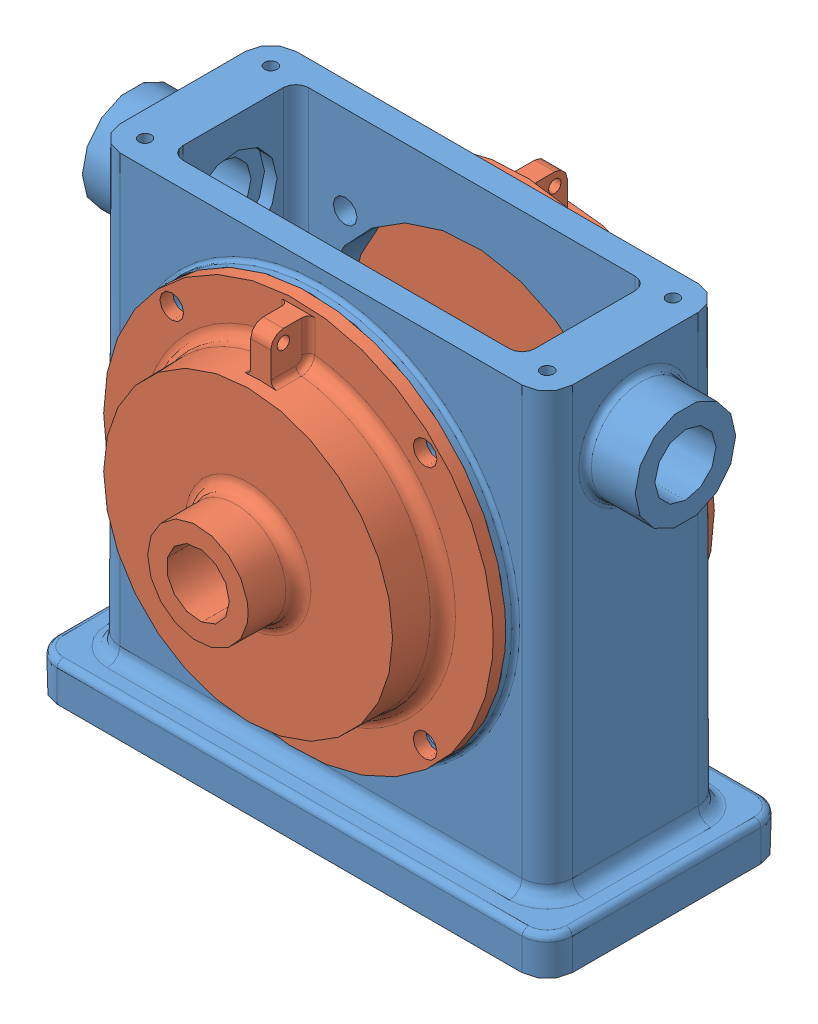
SolidWorks assembly Hole_Alignment.SLDASM, configuration Default (file format 11000). Lengths in mm.
Overall size (139.7 120.65 106.68).
3 component instances, 2 part files, 6 mates.
Components (placement in the parent):
- Rect-1: Rect.SLDPRT [Default] at origin size (139.7 120.65 60.32)
- Circ-1: Circ.SLDPRT [Default] at (0 67.31 24.765) size (98.42 98.42 28.57)
- Circ-2: Circ.SLDPRT [Default] at (0 67.31 -24.765) x (-1 0 0) z (0 0 -1) size (98.42 98.42 28.57)
Mates (geometry in assembly coordinates):
- Concentric1: concentric: cylinder of Rect-1 through (0 67.31 24.765) axis (0 0 -1) radius 49.2125; cylinder of Circ-1 through (0 67.31 27.94) axis (0 0 -1) radius 49.2125
- Coincident1: coincident: plane of Rect-1 through (0 67.31 24.765) normal (0 0 1); plane of Circ-1 through (0 67.31 24.765) normal (0 0 -1)
- Parallel1: parallel: plane of Rect-1 through (57.15 120.65 22.225) normal (1 0 0); plane of Circ-1 through (2.54 114.935 27.94) normal (1 0 0)
- Coincident3: coincident: plane of Rect-1 through (0 67.31 -24.765) normal (0 0 -1); plane of Circ-2 through (0 67.31 -24.765) normal (0 0 1)
- Concentric2: concentric: cylinder of Rect-1 through (0 67.31 -24.765) axis (0 0 1) radius 49.2125; cylinder of Circ-2 through (0 67.31 -27.94) axis (0 0 1) radius 49.2125
- Parallel2: parallel: plane of Rect-1 through (57.15 120.65 22.225) normal (1 0 0); plane of Circ-2 through (2.54 114.935 -27.94) normal (1 0 0)
